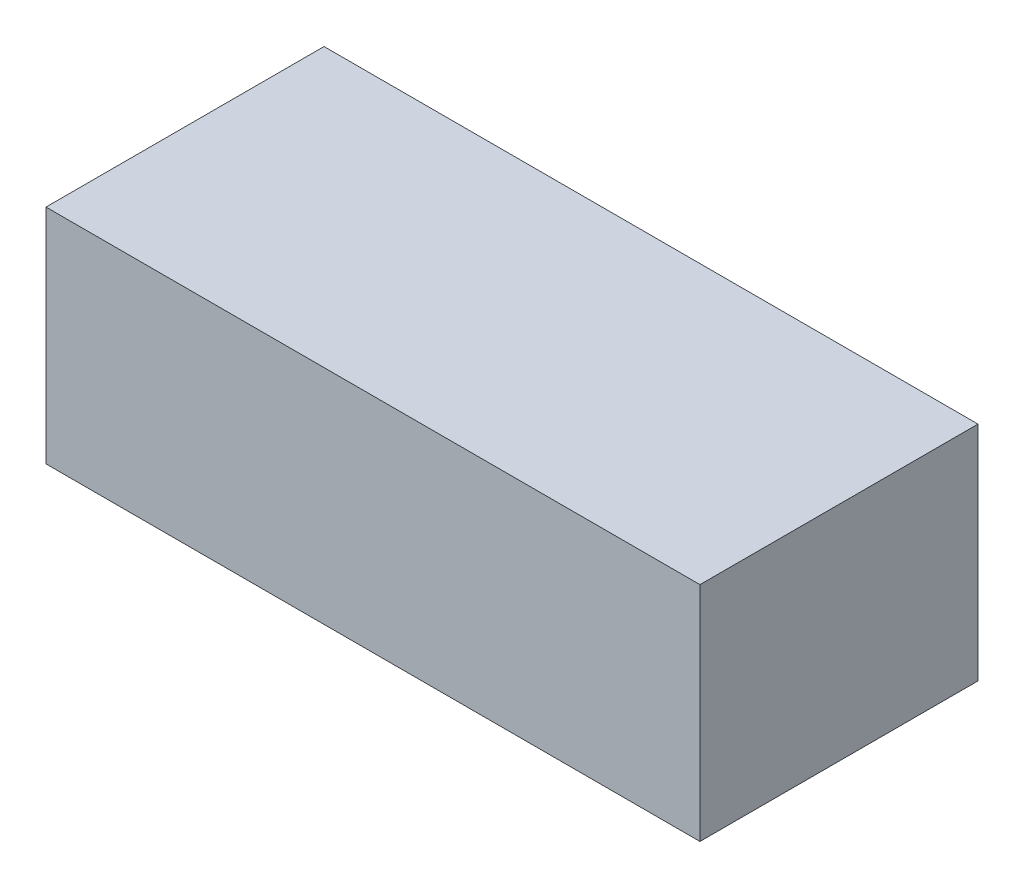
from build123d import *

# Parameters (mm, degrees)
ESQUISSE1_W        = 2.94
ESQUISSE1_H        = 1.25
BOSS_EXTRU_1_DEPTH = 1


with BuildPart() as part:
    # Esquisse1 → Boss.-Extru.1 (new body)
    with BuildSketch(Plane(origin=(0, 0, 0), x_dir=(1, 0, 0), z_dir=(0, 1, 0))):
        Rectangle(ESQUISSE1_W, ESQUISSE1_H)
    extrude(amount=BOSS_EXTRU_1_DEPTH)


solid = part.part
